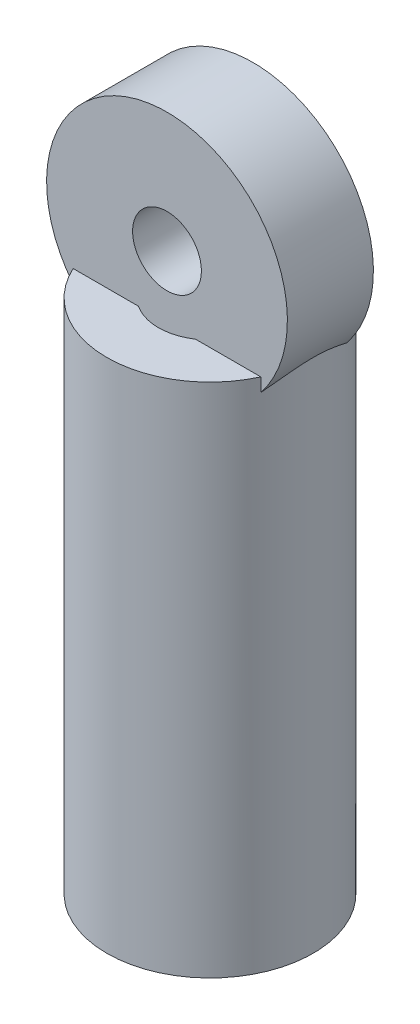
from build123d import *

# Parameters (mm, degrees)
SKETCH1_R           = 7
SKETCH1_R_2         = 2
BOSS_EXTRUDE1_DEPTH = 2.5
SKETCH2_W           = 3
SKETCH2_H           = 30


with BuildPart() as part:
    # Sketch1 → Boss-Extrude1 (new, symmetric)
    with BuildSketch(Plane.XY):
        Circle(SKETCH1_R)
        Circle(SKETCH1_R_2, mode=Mode.SUBTRACT)
    extrude(amount=BOSS_EXTRUDE1_DEPTH, both=True)

    # Sketch2 → Revolve1 (revolve)
    with BuildSketch(Plane.XY, mode=Mode.PRIVATE) as revolve1_sk:
        with Locations((4.5, -18.605551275)):
            Rectangle(SKETCH2_W, SKETCH2_H)
    revolve(revolve1_sk.sketch.rotate(Axis((0, 0, 0), (0, -1, 0)), 90), axis=Axis((0, 0, 0), (0, -1, 0)))


solid = part.part
